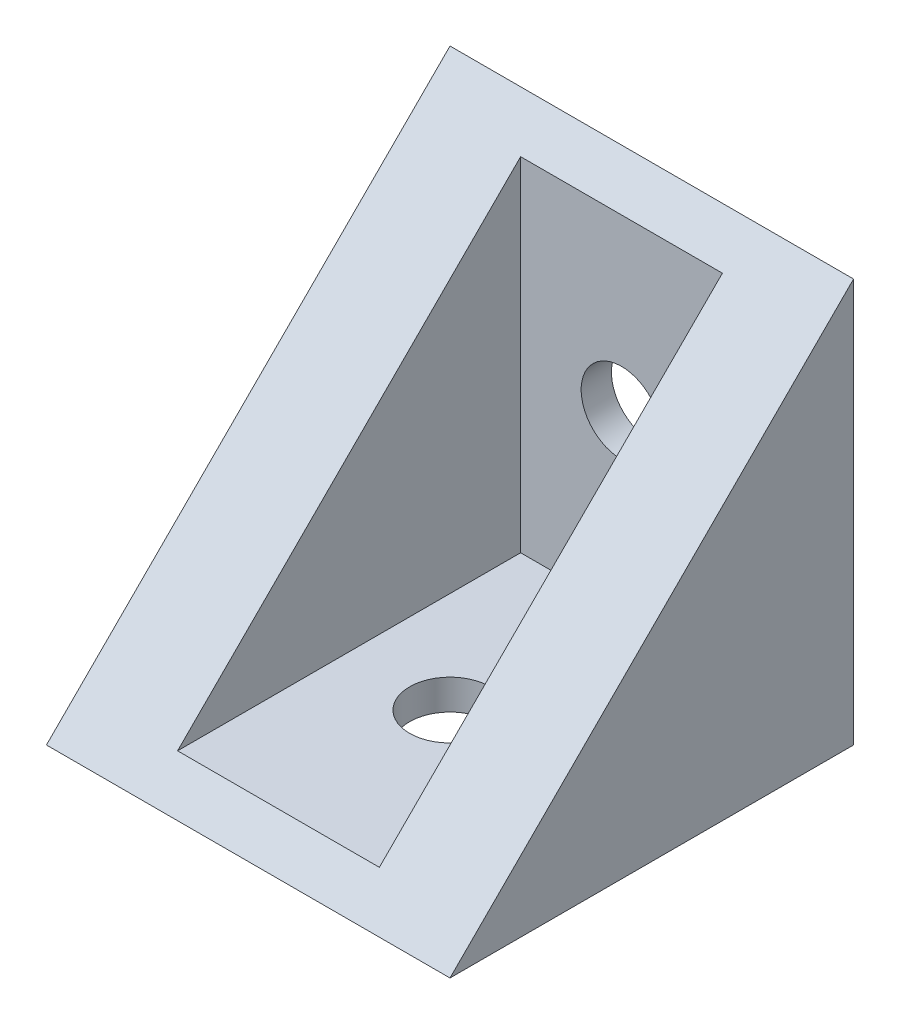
from build123d import *

# Parameters (mm, degrees)
BOSS_EXTRUDE1_DEPTH = 20
SKETCH2_W           = 10
SKETCH2_H           = 18.5
CUT_EXTRUDE2_DEPTH  = 18.5
SKETCH4_R           = 2
CUT_EXTRUDE3_DEPTH  = 16
SKETCH5_R           = 2
CUT_EXTRUDE4_DEPTH  = 16


with BuildPart() as part:
    # Sketch1 → Boss-Extrude1 (new body)
    with BuildSketch(Plane(origin=(0, 0, 0), x_dir=(0, 0, -1), z_dir=(1, 0, 0))):
        Polygon((-20, 0), (0, 0), (0, 20), align=None)
    extrude(amount=BOSS_EXTRUDE1_DEPTH)

    # Sketch2 → Cut-Extrude2 (cut)
    with BuildSketch(Plane(origin=(0, 20, 0), x_dir=(1, 0, 0), z_dir=(0, 1, 0))):
        with Locations((10, -10.75)):
            Rectangle(SKETCH2_W, SKETCH2_H)
    extrude(amount=-CUT_EXTRUDE2_DEPTH, mode=Mode.SUBTRACT)

    # Sketch4 → Cut-Extrude3 (cut)
    with BuildSketch(Plane(origin=(0, 1.5, 0), x_dir=(1, 0, 0), z_dir=(0, 1, 0))):
        with Locations(Location((10, -10, 0), (0, 0, 270))):
            Circle(SKETCH4_R)
    extrude(amount=-CUT_EXTRUDE3_DEPTH, mode=Mode.SUBTRACT)

    # Sketch5 → Cut-Extrude4 (cut)
    with BuildSketch(Plane.XY.offset(1.5)):
        with Locations((10, 10)):
            Circle(SKETCH5_R)
    extrude(amount=-CUT_EXTRUDE4_DEPTH, mode=Mode.SUBTRACT)


solid = part.part
